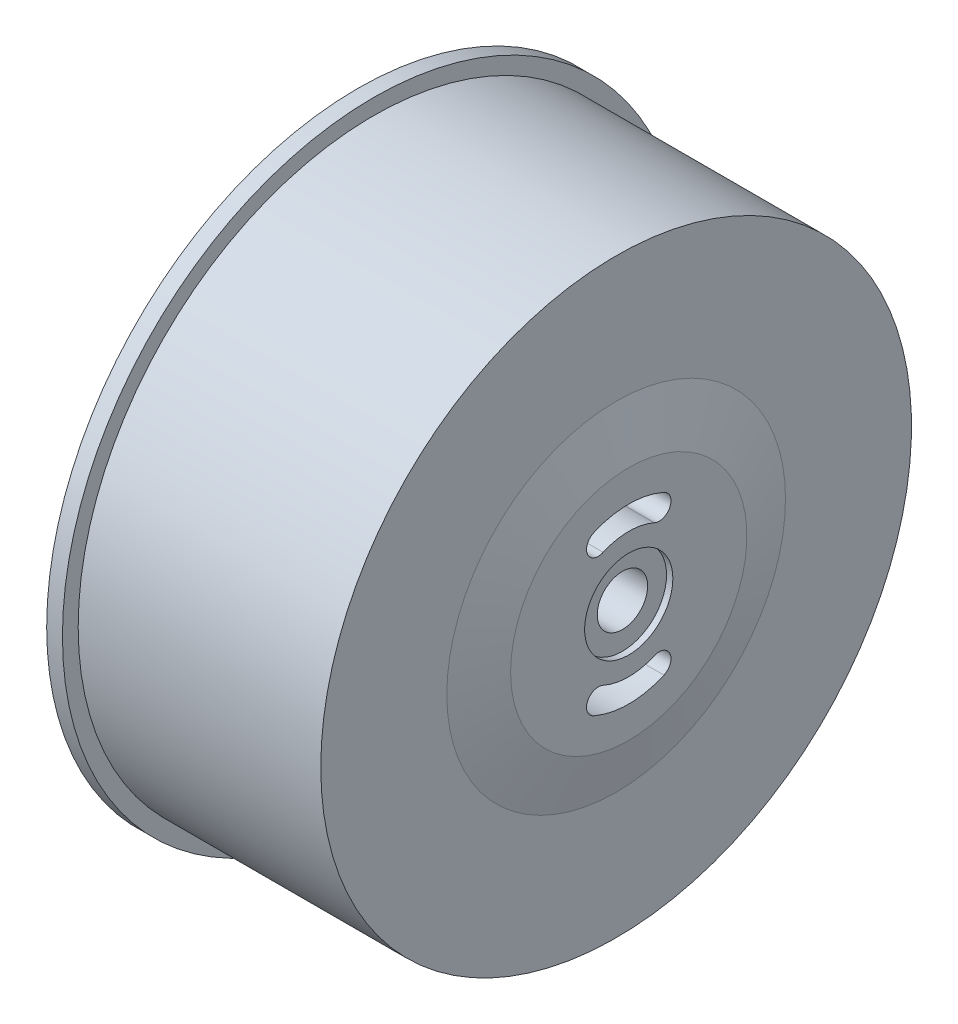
ISO-10303-21;
HEADER;
FILE_DESCRIPTION(('STEP AP214'),'2;1');
FILE_NAME('part.step','',(''),(''),'','','');
FILE_SCHEMA(('AUTOMOTIVE_DESIGN { 1 0 10303 214 1 1 1 1 }'));
ENDSEC;
DATA;
#1=APPLICATION_CONTEXT('core data for automotive mechanical design processes');
#2=APPLICATION_PROTOCOL_DEFINITION('international standard','automotive_design',2000,#1);
#3=PRODUCT_CONTEXT('',#1,'mechanical');
#4=PRODUCT('Part','Part','',(#3));
#5=PRODUCT_RELATED_PRODUCT_CATEGORY('part','',(#4));
#6=PRODUCT_DEFINITION_FORMATION('','',#4);
#7=PRODUCT_DEFINITION_CONTEXT('part definition',#1,'design');
#8=PRODUCT_DEFINITION('design','',#6,#7);
#9=PRODUCT_DEFINITION_SHAPE('','',#8);
#10=(LENGTH_UNIT() NAMED_UNIT(*) SI_UNIT(.MILLI.,.METRE.));
#11=(NAMED_UNIT(*) PLANE_ANGLE_UNIT() SI_UNIT($,.RADIAN.));
#12=(NAMED_UNIT(*) SI_UNIT($,.STERADIAN.) SOLID_ANGLE_UNIT());
#13=UNCERTAINTY_MEASURE_WITH_UNIT(LENGTH_MEASURE(1.E-05),#10,'distance_accuracy_value','');
#14=(GEOMETRIC_REPRESENTATION_CONTEXT(3) GLOBAL_UNCERTAINTY_ASSIGNED_CONTEXT((#13)) GLOBAL_UNIT_ASSIGNED_CONTEXT((#10,
#11,#12)) REPRESENTATION_CONTEXT('',''));
#15=CARTESIAN_POINT('',(0.,0.,0.));
#16=DIRECTION('',(0.,0.,1.));
#17=DIRECTION('',(1.,0.,0.));
#18=AXIS2_PLACEMENT_3D('',#15,#16,#17);
#19=CARTESIAN_POINT('',(17.2,0.,0.));
#20=DIRECTION('',(-1.,0.,0.));
#21=DIRECTION('',(0.,0.,1.));
#22=AXIS2_PLACEMENT_3D('',#19,#20,#21);
#23=CYLINDRICAL_SURFACE('',#22,1.6);
#24=CARTESIAN_POINT('',(10.9,0.,0.));
#25=DIRECTION('',(-1.,0.,0.));
#26=DIRECTION('',(0.,0.,1.));
#27=AXIS2_PLACEMENT_3D('',#24,#25,#26);
#28=CIRCLE('',#27,1.6);
#29=CARTESIAN_POINT('',(10.9,0.,1.6));
#30=VERTEX_POINT('',#29);
#31=EDGE_CURVE('E428',#30,#30,#28,.T.);
#32=ORIENTED_EDGE('',*,*,#31,.T.);
#33=EDGE_LOOP('',(#32));
#34=FACE_BOUND('',#33,.T.);
#35=CARTESIAN_POINT('',(16.8,0.,0.));
#36=DIRECTION('',(1.,0.,0.));
#37=DIRECTION('',(0.,0.,-1.));
#38=AXIS2_PLACEMENT_3D('',#35,#36,#37);
#39=CIRCLE('',#38,1.6);
#40=CARTESIAN_POINT('',(16.8,0.,-1.6));
#41=VERTEX_POINT('',#40);
#42=EDGE_CURVE('E36',#41,#41,#39,.F.);
#43=ORIENTED_EDGE('',*,*,#42,.F.);
#44=EDGE_LOOP('',(#43));
#45=FACE_BOUND('',#44,.T.);
#46=ADVANCED_FACE('F32',(#34,#45),#23,.F.);
#47=CARTESIAN_POINT('',(11.7,0.,0.));
#48=DIRECTION('',(-1.,0.,0.));
#49=DIRECTION('',(0.,0.,1.));
#50=AXIS2_PLACEMENT_3D('',#47,#48,#49);
#51=PLANE('',#50);
#52=CARTESIAN_POINT('',(11.7,0.,0.));
#53=DIRECTION('',(-1.,0.,0.));
#54=DIRECTION('',(0.,0.,1.));
#55=AXIS2_PLACEMENT_3D('',#52,#53,#54);
#56=CIRCLE('',#55,4.);
#57=CARTESIAN_POINT('',(11.7,0.,4.));
#58=VERTEX_POINT('',#57);
#59=EDGE_CURVE('E127',#58,#58,#56,.T.);
#60=ORIENTED_EDGE('',*,*,#59,.T.);
#61=EDGE_LOOP('',(#60));
#62=FACE_BOUND('',#61,.T.);
#63=CARTESIAN_POINT('',(11.7,0.,0.));
#64=DIRECTION('',(-1.,0.,0.));
#65=DIRECTION('',(0.,0.,1.));
#66=AXIS2_PLACEMENT_3D('',#63,#64,#65);
#67=CIRCLE('',#66,2.5);
#68=CARTESIAN_POINT('',(11.7,0.,2.5));
#69=VERTEX_POINT('',#68);
#70=EDGE_CURVE('E129',#69,#69,#67,.T.);
#71=ORIENTED_EDGE('',*,*,#70,.F.);
#72=EDGE_LOOP('',(#71));
#73=FACE_BOUND('',#72,.T.);
#74=ADVANCED_FACE('F225',(#62,#73),#51,.T.);
#75=CARTESIAN_POINT('',(14.7,16.25,0.));
#76=DIRECTION('',(1.,0.,0.));
#77=DIRECTION('',(0.,0.,-1.));
#78=AXIS2_PLACEMENT_3D('',#75,#76,#77);
#79=PLANE('',#78);
#80=CARTESIAN_POINT('',(14.7,0.,0.));
#81=DIRECTION('',(-1.,0.,0.));
#82=DIRECTION('',(0.,0.,1.));
#83=AXIS2_PLACEMENT_3D('',#80,#81,#82);
#84=CIRCLE('',#83,16.25);
#85=CARTESIAN_POINT('',(14.7,0.,16.25));
#86=VERTEX_POINT('',#85);
#87=EDGE_CURVE('E170',#86,#86,#84,.T.);
#88=ORIENTED_EDGE('',*,*,#87,.T.);
#89=EDGE_LOOP('',(#88));
#90=FACE_BOUND('',#89,.T.);
#91=CARTESIAN_POINT('',(14.7,0.,0.));
#92=DIRECTION('',(-1.,0.,0.));
#93=DIRECTION('',(0.,0.,1.));
#94=AXIS2_PLACEMENT_3D('',#91,#92,#93);
#95=CIRCLE('',#94,4.);
#96=CARTESIAN_POINT('',(14.7,-3.65500452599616,1.625097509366));
#97=VERTEX_POINT('',#96);
#98=CARTESIAN_POINT('',(14.7,3.65500452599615,1.62509750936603));
#99=VERTEX_POINT('',#98);
#100=EDGE_CURVE('E114',#97,#99,#95,.T.);
#101=ORIENTED_EDGE('',*,*,#100,.F.);
#102=CARTESIAN_POINT('',(14.7,-4.34031787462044,1.92980329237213));
#103=DIRECTION('',(1.,0.,0.));
#104=DIRECTION('',(0.,0.,-1.));
#105=AXIS2_PLACEMENT_3D('',#102,#103,#104);
#106=CIRCLE('',#105,0.750000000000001);
#107=CARTESIAN_POINT('',(14.7,-5.02563122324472,2.23450907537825));
#108=VERTEX_POINT('',#107);
#109=EDGE_CURVE('E98',#97,#108,#106,.T.);
#110=ORIENTED_EDGE('',*,*,#109,.T.);
#111=CARTESIAN_POINT('',(14.7,0.,0.));
#112=DIRECTION('',(1.,0.,0.));
#113=DIRECTION('',(0.,0.,-1.));
#114=AXIS2_PLACEMENT_3D('',#111,#112,#113);
#115=CIRCLE('',#114,5.5);
#116=CARTESIAN_POINT('',(14.7,-5.02563122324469,-2.23450907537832));
#117=VERTEX_POINT('',#116);
#118=EDGE_CURVE('E41',#108,#117,#115,.T.);
#119=ORIENTED_EDGE('',*,*,#118,.T.);
#120=CARTESIAN_POINT('',(14.7,-4.34031787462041,-1.92980329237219));
#121=DIRECTION('',(1.,0.,0.));
#122=DIRECTION('',(0.,0.,-1.));
#123=AXIS2_PLACEMENT_3D('',#120,#121,#122);
#124=CIRCLE('',#123,0.750000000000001);
#125=CARTESIAN_POINT('',(14.7,-3.65500452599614,-1.62509750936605));
#126=VERTEX_POINT('',#125);
#127=EDGE_CURVE('E11',#117,#126,#124,.T.);
#128=ORIENTED_EDGE('',*,*,#127,.T.);
#129=CARTESIAN_POINT('',(14.7,3.65500452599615,-1.62509750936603));
#130=VERTEX_POINT('',#129);
#131=EDGE_CURVE('E123',#130,#126,#95,.T.);
#132=ORIENTED_EDGE('',*,*,#131,.F.);
#133=CARTESIAN_POINT('',(14.7,4.34031787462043,-1.92980329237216));
#134=DIRECTION('',(1.,0.,0.));
#135=DIRECTION('',(0.,0.,-1.));
#136=AXIS2_PLACEMENT_3D('',#133,#134,#135);
#137=CIRCLE('',#136,0.750000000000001);
#138=CARTESIAN_POINT('',(14.7,5.02563122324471,-2.23450907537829));
#139=VERTEX_POINT('',#138);
#140=EDGE_CURVE('E188',#130,#139,#137,.T.);
#141=ORIENTED_EDGE('',*,*,#140,.T.);
#142=CARTESIAN_POINT('',(14.7,0.,0.));
#143=DIRECTION('',(1.,0.,0.));
#144=DIRECTION('',(0.,0.,-1.));
#145=AXIS2_PLACEMENT_3D('',#142,#143,#144);
#146=CIRCLE('',#145,5.5);
#147=CARTESIAN_POINT('',(14.7,5.02563122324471,2.23450907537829));
#148=VERTEX_POINT('',#147);
#149=EDGE_CURVE('E191',#139,#148,#146,.T.);
#150=ORIENTED_EDGE('',*,*,#149,.T.);
#151=CARTESIAN_POINT('',(14.7,4.34031787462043,1.92980329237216));
#152=DIRECTION('',(1.,0.,0.));
#153=DIRECTION('',(0.,0.,-1.));
#154=AXIS2_PLACEMENT_3D('',#151,#152,#153);
#155=CIRCLE('',#154,0.750000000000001);
#156=EDGE_CURVE('E108',#148,#99,#155,.T.);
#157=ORIENTED_EDGE('',*,*,#156,.T.);
#158=EDGE_LOOP('',(#101,#110,#119,#128,#132,#141,#150,#157));
#159=FACE_BOUND('',#158,.T.);
#160=ADVANCED_FACE('F121',(#90,#159),#79,.F.);
#161=CARTESIAN_POINT('',(14.7,0.,0.));
#162=DIRECTION('',(-1.,0.,0.));
#163=DIRECTION('',(0.,0.,1.));
#164=AXIS2_PLACEMENT_3D('',#161,#162,#163);
#165=CYLINDRICAL_SURFACE('',#164,19.75);
#166=CARTESIAN_POINT('',(0.,0.,0.));
#167=DIRECTION('',(-1.,0.,0.));
#168=DIRECTION('',(0.,0.,1.));
#169=AXIS2_PLACEMENT_3D('',#166,#167,#168);
#170=CIRCLE('',#169,19.75);
#171=CARTESIAN_POINT('',(0.,0.,19.75));
#172=VERTEX_POINT('',#171);
#173=EDGE_CURVE('E159',#172,#172,#170,.T.);
#174=ORIENTED_EDGE('',*,*,#173,.F.);
#175=EDGE_LOOP('',(#174));
#176=FACE_BOUND('',#175,.T.);
#177=CARTESIAN_POINT('',(0.999999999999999,0.,0.));
#178=DIRECTION('',(-1.,0.,0.));
#179=DIRECTION('',(0.,0.,1.));
#180=AXIS2_PLACEMENT_3D('',#177,#178,#179);
#181=CIRCLE('',#180,19.75);
#182=CARTESIAN_POINT('',(0.999999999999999,0.,19.75));
#183=VERTEX_POINT('',#182);
#184=EDGE_CURVE('E185',#183,#183,#181,.T.);
#185=ORIENTED_EDGE('',*,*,#184,.T.);
#186=EDGE_LOOP('',(#185));
#187=FACE_BOUND('',#186,.T.);
#188=ADVANCED_FACE('F34',(#176,#187),#165,.T.);
#189=CARTESIAN_POINT('',(1.,19.75,0.));
#190=DIRECTION('',(-1.,0.,0.));
#191=DIRECTION('',(0.,0.,1.));
#192=AXIS2_PLACEMENT_3D('',#189,#190,#191);
#193=PLANE('',#192);
#194=ORIENTED_EDGE('',*,*,#184,.F.);
#195=EDGE_LOOP('',(#194));
#196=FACE_BOUND('',#195,.T.);
#197=CARTESIAN_POINT('',(1.,0.,0.));
#198=DIRECTION('',(-1.,0.,0.));
#199=DIRECTION('',(0.,0.,1.));
#200=AXIS2_PLACEMENT_3D('',#197,#198,#199);
#201=CIRCLE('',#200,18.75);
#202=CARTESIAN_POINT('',(1.,0.,18.75));
#203=VERTEX_POINT('',#202);
#204=EDGE_CURVE('E182',#203,#203,#201,.T.);
#205=ORIENTED_EDGE('',*,*,#204,.T.);
#206=EDGE_LOOP('',(#205));
#207=FACE_BOUND('',#206,.T.);
#208=ADVANCED_FACE('F279',(#196,#207),#193,.F.);
#209=CARTESIAN_POINT('',(14.7,0.,0.));
#210=DIRECTION('',(-1.,0.,0.));
#211=DIRECTION('',(0.,0.,1.));
#212=AXIS2_PLACEMENT_3D('',#209,#210,#211);
#213=CYLINDRICAL_SURFACE('',#212,18.75);
#214=ORIENTED_EDGE('',*,*,#204,.F.);
#215=EDGE_LOOP('',(#214));
#216=FACE_BOUND('',#215,.T.);
#217=CARTESIAN_POINT('',(16.4,0.,0.));
#218=DIRECTION('',(-1.,0.,0.));
#219=DIRECTION('',(0.,0.,1.));
#220=AXIS2_PLACEMENT_3D('',#217,#218,#219);
#221=CIRCLE('',#220,18.75);
#222=CARTESIAN_POINT('',(16.4,0.,18.75));
#223=VERTEX_POINT('',#222);
#224=EDGE_CURVE('E179',#223,#223,#221,.T.);
#225=ORIENTED_EDGE('',*,*,#224,.T.);
#226=EDGE_LOOP('',(#225));
#227=FACE_BOUND('',#226,.T.);
#228=ADVANCED_FACE('F220',(#216,#227),#213,.T.);
#229=CARTESIAN_POINT('',(16.4,18.75,0.));
#230=DIRECTION('',(-1.,0.,0.));
#231=DIRECTION('',(0.,0.,1.));
#232=AXIS2_PLACEMENT_3D('',#229,#230,#231);
#233=PLANE('',#232);
#234=ORIENTED_EDGE('',*,*,#224,.F.);
#235=EDGE_LOOP('',(#234));
#236=FACE_BOUND('',#235,.T.);
#237=CARTESIAN_POINT('',(16.4,0.,0.));
#238=DIRECTION('',(-1.,0.,0.));
#239=DIRECTION('',(0.,0.,1.));
#240=AXIS2_PLACEMENT_3D('',#237,#238,#239);
#241=CIRCLE('',#240,10.75);
#242=CARTESIAN_POINT('',(16.4,0.,10.75));
#243=VERTEX_POINT('',#242);
#244=EDGE_CURVE('E176',#243,#243,#241,.T.);
#245=ORIENTED_EDGE('',*,*,#244,.T.);
#246=EDGE_LOOP('',(#245));
#247=FACE_BOUND('',#246,.T.);
#248=ADVANCED_FACE('F214',(#236,#247),#233,.F.);
#249=CARTESIAN_POINT('',(17.2,0.,0.));
#250=DIRECTION('',(-1.,0.,0.));
#251=DIRECTION('',(0.,0.,1.));
#252=AXIS2_PLACEMENT_3D('',#249,#250,#251);
#253=CONICAL_SURFACE('',#252,7.5,1.32944083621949);
#254=ORIENTED_EDGE('',*,*,#244,.F.);
#255=EDGE_LOOP('',(#254));
#256=FACE_BOUND('',#255,.T.);
#257=CARTESIAN_POINT('',(17.2,0.,0.));
#258=DIRECTION('',(-1.,0.,0.));
#259=DIRECTION('',(0.,0.,1.));
#260=AXIS2_PLACEMENT_3D('',#257,#258,#259);
#261=CIRCLE('',#260,7.5);
#262=CARTESIAN_POINT('',(17.2,0.,7.5));
#263=VERTEX_POINT('',#262);
#264=EDGE_CURVE('E173',#263,#263,#261,.T.);
#265=ORIENTED_EDGE('',*,*,#264,.T.);
#266=EDGE_LOOP('',(#265));
#267=FACE_BOUND('',#266,.T.);
#268=ADVANCED_FACE('F205',(#256,#267),#253,.T.);
#269=CARTESIAN_POINT('',(17.2,7.5,0.));
#270=DIRECTION('',(-1.,0.,0.));
#271=DIRECTION('',(0.,0.,1.));
#272=AXIS2_PLACEMENT_3D('',#269,#270,#271);
#273=PLANE('',#272);
#274=CARTESIAN_POINT('',(17.2,0.,0.));
#275=DIRECTION('',(1.,0.,0.));
#276=DIRECTION('',(0.,0.,-1.));
#277=AXIS2_PLACEMENT_3D('',#274,#275,#276);
#278=CIRCLE('',#277,2.8);
#279=CARTESIAN_POINT('',(17.2,0.,-2.8));
#280=VERTEX_POINT('',#279);
#281=EDGE_CURVE('E424',#280,#280,#278,.T.);
#282=ORIENTED_EDGE('',*,*,#281,.F.);
#283=EDGE_LOOP('',(#282));
#284=FACE_BOUND('',#283,.T.);
#285=CARTESIAN_POINT('',(17.2,0.,0.));
#286=DIRECTION('',(-1.,0.,0.));
#287=DIRECTION('',(0.,0.,1.));
#288=AXIS2_PLACEMENT_3D('',#285,#286,#287);
#289=CIRCLE('',#288,4.);
#290=CARTESIAN_POINT('',(17.2,-3.65500452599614,-1.62509750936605));
#291=VERTEX_POINT('',#290);
#292=CARTESIAN_POINT('',(17.2,-3.65500452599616,1.625097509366));
#293=VERTEX_POINT('',#292);
#294=EDGE_CURVE('E116',#291,#293,#289,.T.);
#295=ORIENTED_EDGE('',*,*,#294,.F.);
#296=CARTESIAN_POINT('',(17.2,-4.34031787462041,-1.92980329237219));
#297=DIRECTION('',(1.,0.,0.));
#298=DIRECTION('',(0.,0.,-1.));
#299=AXIS2_PLACEMENT_3D('',#296,#297,#298);
#300=CIRCLE('',#299,0.750000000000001);
#301=CARTESIAN_POINT('',(17.2,-5.02563122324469,-2.23450907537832));
#302=VERTEX_POINT('',#301);
#303=EDGE_CURVE('E48',#302,#291,#300,.T.);
#304=ORIENTED_EDGE('',*,*,#303,.F.);
#305=CARTESIAN_POINT('',(17.2,0.,0.));
#306=DIRECTION('',(1.,0.,0.));
#307=DIRECTION('',(0.,0.,1.));
#308=AXIS2_PLACEMENT_3D('',#305,#306,#307);
#309=CIRCLE('',#308,5.5);
#310=CARTESIAN_POINT('',(17.2,-5.02563122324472,2.23450907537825));
#311=VERTEX_POINT('',#310);
#312=EDGE_CURVE('E139',#311,#302,#309,.T.);
#313=ORIENTED_EDGE('',*,*,#312,.F.);
#314=CARTESIAN_POINT('',(17.2,-4.34031787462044,1.92980329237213));
#315=DIRECTION('',(1.,0.,0.));
#316=DIRECTION('',(0.,0.,1.));
#317=AXIS2_PLACEMENT_3D('',#314,#315,#316);
#318=CIRCLE('',#317,0.750000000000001);
#319=EDGE_CURVE('E137',#293,#311,#318,.T.);
#320=ORIENTED_EDGE('',*,*,#319,.F.);
#321=EDGE_LOOP('',(#295,#304,#313,#320));
#322=FACE_BOUND('',#321,.T.);
#323=CARTESIAN_POINT('',(17.2,0.,0.));
#324=DIRECTION('',(-1.,0.,0.));
#325=DIRECTION('',(0.,0.,-1.));
#326=AXIS2_PLACEMENT_3D('',#323,#324,#325);
#327=CIRCLE('',#326,4.);
#328=CARTESIAN_POINT('',(17.2,3.65500452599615,1.62509750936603));
#329=VERTEX_POINT('',#328);
#330=CARTESIAN_POINT('',(17.2,3.65500452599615,-1.62509750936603));
#331=VERTEX_POINT('',#330);
#332=EDGE_CURVE('E147',#329,#331,#327,.T.);
#333=ORIENTED_EDGE('',*,*,#332,.F.);
#334=CARTESIAN_POINT('',(17.2,4.34031787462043,1.92980329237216));
#335=DIRECTION('',(1.,0.,0.));
#336=DIRECTION('',(0.,0.,1.));
#337=AXIS2_PLACEMENT_3D('',#334,#335,#336);
#338=CIRCLE('',#337,0.750000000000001);
#339=CARTESIAN_POINT('',(17.2,5.02563122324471,2.23450907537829));
#340=VERTEX_POINT('',#339);
#341=EDGE_CURVE('E56',#340,#329,#338,.T.);
#342=ORIENTED_EDGE('',*,*,#341,.F.);
#343=CARTESIAN_POINT('',(17.2,0.,0.));
#344=DIRECTION('',(1.,0.,0.));
#345=DIRECTION('',(0.,0.,-1.));
#346=AXIS2_PLACEMENT_3D('',#343,#344,#345);
#347=CIRCLE('',#346,5.5);
#348=CARTESIAN_POINT('',(17.2,5.02563122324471,-2.23450907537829));
#349=VERTEX_POINT('',#348);
#350=EDGE_CURVE('E153',#349,#340,#347,.T.);
#351=ORIENTED_EDGE('',*,*,#350,.F.);
#352=CARTESIAN_POINT('',(17.2,4.34031787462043,-1.92980329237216));
#353=DIRECTION('',(1.,0.,0.));
#354=DIRECTION('',(0.,0.,-1.));
#355=AXIS2_PLACEMENT_3D('',#352,#353,#354);
#356=CIRCLE('',#355,0.750000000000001);
#357=EDGE_CURVE('E150',#331,#349,#356,.T.);
#358=ORIENTED_EDGE('',*,*,#357,.F.);
#359=EDGE_LOOP('',(#333,#342,#351,#358));
#360=FACE_BOUND('',#359,.T.);
#361=ORIENTED_EDGE('',*,*,#264,.F.);
#362=EDGE_LOOP('',(#361));
#363=FACE_BOUND('',#362,.T.);
#364=ADVANCED_FACE('F201',(#284,#322,#360,#363),#273,.F.);
#365=CARTESIAN_POINT('',(14.7,0.,0.));
#366=DIRECTION('',(-1.,0.,0.));
#367=DIRECTION('',(0.,0.,1.));
#368=AXIS2_PLACEMENT_3D('',#365,#366,#367);
#369=CYLINDRICAL_SURFACE('',#368,16.25);
#370=ORIENTED_EDGE('',*,*,#87,.F.);
#371=EDGE_LOOP('',(#370));
#372=FACE_BOUND('',#371,.T.);
#373=CARTESIAN_POINT('',(0.,0.,0.));
#374=DIRECTION('',(-1.,0.,0.));
#375=DIRECTION('',(0.,0.,1.));
#376=AXIS2_PLACEMENT_3D('',#373,#374,#375);
#377=CIRCLE('',#376,16.25);
#378=CARTESIAN_POINT('',(0.,0.,16.25));
#379=VERTEX_POINT('',#378);
#380=EDGE_CURVE('E167',#379,#379,#377,.T.);
#381=ORIENTED_EDGE('',*,*,#380,.T.);
#382=EDGE_LOOP('',(#381));
#383=FACE_BOUND('',#382,.T.);
#384=ADVANCED_FACE('F204',(#372,#383),#369,.F.);
#385=CARTESIAN_POINT('',(0.,16.25,0.));
#386=DIRECTION('',(1.,0.,0.));
#387=DIRECTION('',(0.,0.,-1.));
#388=AXIS2_PLACEMENT_3D('',#385,#386,#387);
#389=PLANE('',#388);
#390=ORIENTED_EDGE('',*,*,#380,.F.);
#391=EDGE_LOOP('',(#390));
#392=FACE_BOUND('',#391,.T.);
#393=ORIENTED_EDGE('',*,*,#173,.T.);
#394=EDGE_LOOP('',(#393));
#395=FACE_BOUND('',#394,.T.);
#396=ADVANCED_FACE('F267',(#392,#395),#389,.F.);
#397=CARTESIAN_POINT('',(0.,4.34031787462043,1.92980329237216));
#398=DIRECTION('',(1.,0.,0.));
#399=DIRECTION('',(0.,0.,-1.));
#400=AXIS2_PLACEMENT_3D('',#397,#398,#399);
#401=CYLINDRICAL_SURFACE('',#400,0.750000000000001);
#402=DIRECTION('',(1.,0.,0.));
#403=VECTOR('',#402,1.);
#404=CARTESIAN_POINT('',(0.,5.02563122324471,2.23450907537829));
#405=LINE('',#404,#403);
#406=EDGE_CURVE('E157',#148,#340,#405,.T.);
#407=ORIENTED_EDGE('',*,*,#406,.T.);
#408=ORIENTED_EDGE('',*,*,#341,.T.);
#409=DIRECTION('',(1.,0.,0.));
#410=VECTOR('',#409,1.);
#411=CARTESIAN_POINT('',(0.,3.65500452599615,1.62509750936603));
#412=LINE('',#411,#410);
#413=EDGE_CURVE('E156',#99,#329,#412,.T.);
#414=ORIENTED_EDGE('',*,*,#413,.F.);
#415=ORIENTED_EDGE('',*,*,#156,.F.);
#416=EDGE_LOOP('',(#407,#408,#414,#415));
#417=FACE_BOUND('',#416,.T.);
#418=ADVANCED_FACE('F258',(#417),#401,.F.);
#419=CARTESIAN_POINT('',(0.,0.,0.));
#420=DIRECTION('',(1.,0.,0.));
#421=DIRECTION('',(0.,0.,-1.));
#422=AXIS2_PLACEMENT_3D('',#419,#420,#421);
#423=CYLINDRICAL_SURFACE('',#422,5.5);
#424=DIRECTION('',(1.,0.,0.));
#425=VECTOR('',#424,1.);
#426=CARTESIAN_POINT('',(0.,5.02563122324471,-2.23450907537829));
#427=LINE('',#426,#425);
#428=EDGE_CURVE('E160',#139,#349,#427,.T.);
#429=ORIENTED_EDGE('',*,*,#428,.T.);
#430=ORIENTED_EDGE('',*,*,#350,.T.);
#431=ORIENTED_EDGE('',*,*,#406,.F.);
#432=ORIENTED_EDGE('',*,*,#149,.F.);
#433=EDGE_LOOP('',(#429,#430,#431,#432));
#434=FACE_BOUND('',#433,.T.);
#435=ADVANCED_FACE('F254',(#434),#423,.F.);
#436=CARTESIAN_POINT('',(0.,4.34031787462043,-1.92980329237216));
#437=DIRECTION('',(1.,0.,0.));
#438=DIRECTION('',(0.,0.,-1.));
#439=AXIS2_PLACEMENT_3D('',#436,#437,#438);
#440=CYLINDRICAL_SURFACE('',#439,0.750000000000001);
#441=DIRECTION('',(1.,0.,0.));
#442=VECTOR('',#441,1.);
#443=CARTESIAN_POINT('',(0.,3.65500452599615,-1.62509750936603));
#444=LINE('',#443,#442);
#445=EDGE_CURVE('E162',#130,#331,#444,.T.);
#446=ORIENTED_EDGE('',*,*,#445,.T.);
#447=ORIENTED_EDGE('',*,*,#357,.T.);
#448=ORIENTED_EDGE('',*,*,#428,.F.);
#449=ORIENTED_EDGE('',*,*,#140,.F.);
#450=EDGE_LOOP('',(#446,#447,#448,#449));
#451=FACE_BOUND('',#450,.T.);
#452=ADVANCED_FACE('F257',(#451),#440,.F.);
#453=CARTESIAN_POINT('',(0.,0.,0.));
#454=DIRECTION('',(1.,0.,0.));
#455=DIRECTION('',(0.,0.,-1.));
#456=AXIS2_PLACEMENT_3D('',#453,#454,#455);
#457=CYLINDRICAL_SURFACE('',#456,4.);
#458=ORIENTED_EDGE('',*,*,#413,.T.);
#459=ORIENTED_EDGE('',*,*,#332,.T.);
#460=ORIENTED_EDGE('',*,*,#445,.F.);
#461=ORIENTED_EDGE('',*,*,#131,.T.);
#462=DIRECTION('',(1.,0.,0.));
#463=VECTOR('',#462,1.);
#464=CARTESIAN_POINT('',(0.,-3.65500452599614,-1.62509750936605));
#465=LINE('',#464,#463);
#466=EDGE_CURVE('E118',#126,#291,#465,.T.);
#467=ORIENTED_EDGE('',*,*,#466,.T.);
#468=ORIENTED_EDGE('',*,*,#294,.T.);
#469=DIRECTION('',(1.,0.,0.));
#470=VECTOR('',#469,1.);
#471=CARTESIAN_POINT('',(0.,-3.65500452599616,1.625097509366));
#472=LINE('',#471,#470);
#473=EDGE_CURVE('E102',#97,#293,#472,.T.);
#474=ORIENTED_EDGE('',*,*,#473,.F.);
#475=ORIENTED_EDGE('',*,*,#100,.T.);
#476=EDGE_LOOP('',(#458,#459,#460,#461,#467,#468,#474,#475));
#477=FACE_BOUND('',#476,.T.);
#478=ORIENTED_EDGE('',*,*,#59,.F.);
#479=EDGE_LOOP('',(#478));
#480=FACE_BOUND('',#479,.T.);
#481=ADVANCED_FACE('F112',(#477,#480),#457,.T.);
#482=CARTESIAN_POINT('',(0.,-4.34031787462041,-1.92980329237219));
#483=DIRECTION('',(1.,0.,0.));
#484=DIRECTION('',(0.,0.,-1.));
#485=AXIS2_PLACEMENT_3D('',#482,#483,#484);
#486=CYLINDRICAL_SURFACE('',#485,0.750000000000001);
#487=DIRECTION('',(1.,0.,0.));
#488=VECTOR('',#487,1.);
#489=CARTESIAN_POINT('',(0.,-5.02563122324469,-2.23450907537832));
#490=LINE('',#489,#488);
#491=EDGE_CURVE('E142',#117,#302,#490,.T.);
#492=ORIENTED_EDGE('',*,*,#491,.T.);
#493=ORIENTED_EDGE('',*,*,#303,.T.);
#494=ORIENTED_EDGE('',*,*,#466,.F.);
#495=ORIENTED_EDGE('',*,*,#127,.F.);
#496=EDGE_LOOP('',(#492,#493,#494,#495));
#497=FACE_BOUND('',#496,.T.);
#498=ADVANCED_FACE('F198',(#497),#486,.F.);
#499=CARTESIAN_POINT('',(0.,0.,0.));
#500=DIRECTION('',(1.,0.,0.));
#501=DIRECTION('',(0.,0.,-1.));
#502=AXIS2_PLACEMENT_3D('',#499,#500,#501);
#503=CYLINDRICAL_SURFACE('',#502,5.5);
#504=DIRECTION('',(1.,0.,0.));
#505=VECTOR('',#504,1.);
#506=CARTESIAN_POINT('',(0.,-5.02563122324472,2.23450907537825));
#507=LINE('',#506,#505);
#508=EDGE_CURVE('E104',#108,#311,#507,.T.);
#509=ORIENTED_EDGE('',*,*,#508,.T.);
#510=ORIENTED_EDGE('',*,*,#312,.T.);
#511=ORIENTED_EDGE('',*,*,#491,.F.);
#512=ORIENTED_EDGE('',*,*,#118,.F.);
#513=EDGE_LOOP('',(#509,#510,#511,#512));
#514=FACE_BOUND('',#513,.T.);
#515=ADVANCED_FACE('F196',(#514),#503,.F.);
#516=CARTESIAN_POINT('',(0.,-4.34031787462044,1.92980329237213));
#517=DIRECTION('',(1.,0.,0.));
#518=DIRECTION('',(0.,0.,-1.));
#519=AXIS2_PLACEMENT_3D('',#516,#517,#518);
#520=CYLINDRICAL_SURFACE('',#519,0.750000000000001);
#521=ORIENTED_EDGE('',*,*,#473,.T.);
#522=ORIENTED_EDGE('',*,*,#319,.T.);
#523=ORIENTED_EDGE('',*,*,#508,.F.);
#524=ORIENTED_EDGE('',*,*,#109,.F.);
#525=EDGE_LOOP('',(#521,#522,#523,#524));
#526=FACE_BOUND('',#525,.T.);
#527=ADVANCED_FACE('F100',(#526),#520,.F.);
#528=CARTESIAN_POINT('',(10.9,0.,0.));
#529=DIRECTION('',(1.,0.,0.));
#530=DIRECTION('',(0.,0.,-1.));
#531=AXIS2_PLACEMENT_3D('',#528,#529,#530);
#532=CYLINDRICAL_SURFACE('',#531,2.5);
#533=CARTESIAN_POINT('',(10.9,0.,0.));
#534=DIRECTION('',(-1.,0.,0.));
#535=DIRECTION('',(0.,0.,1.));
#536=AXIS2_PLACEMENT_3D('',#533,#534,#535);
#537=CIRCLE('',#536,2.5);
#538=CARTESIAN_POINT('',(10.9,0.,2.5));
#539=VERTEX_POINT('',#538);
#540=EDGE_CURVE('E124',#539,#539,#537,.T.);
#541=ORIENTED_EDGE('',*,*,#540,.F.);
#542=EDGE_LOOP('',(#541));
#543=FACE_BOUND('',#542,.T.);
#544=ORIENTED_EDGE('',*,*,#70,.T.);
#545=EDGE_LOOP('',(#544));
#546=FACE_BOUND('',#545,.T.);
#547=ADVANCED_FACE('F243',(#543,#546),#532,.T.);
#548=CARTESIAN_POINT('',(10.9,0.,0.));
#549=DIRECTION('',(-1.,0.,0.));
#550=DIRECTION('',(0.,0.,1.));
#551=AXIS2_PLACEMENT_3D('',#548,#549,#550);
#552=PLANE('',#551);
#553=ORIENTED_EDGE('',*,*,#31,.F.);
#554=EDGE_LOOP('',(#553));
#555=FACE_BOUND('',#554,.T.);
#556=ORIENTED_EDGE('',*,*,#540,.T.);
#557=EDGE_LOOP('',(#556));
#558=FACE_BOUND('',#557,.T.);
#559=ADVANCED_FACE('F239',(#555,#558),#552,.T.);
#560=CARTESIAN_POINT('',(16.8,0.,0.));
#561=DIRECTION('',(1.,0.,0.));
#562=DIRECTION('',(0.,0.,-1.));
#563=AXIS2_PLACEMENT_3D('',#560,#561,#562);
#564=PLANE('',#563);
#565=CARTESIAN_POINT('',(16.8,0.,0.));
#566=DIRECTION('',(1.,0.,0.));
#567=DIRECTION('',(0.,0.,-1.));
#568=AXIS2_PLACEMENT_3D('',#565,#566,#567);
#569=CIRCLE('',#568,2.8);
#570=CARTESIAN_POINT('',(16.8,0.,-2.8));
#571=VERTEX_POINT('',#570);
#572=EDGE_CURVE('E421',#571,#571,#569,.T.);
#573=ORIENTED_EDGE('',*,*,#572,.T.);
#574=EDGE_LOOP('',(#573));
#575=FACE_BOUND('',#574,.T.);
#576=ORIENTED_EDGE('',*,*,#42,.T.);
#577=EDGE_LOOP('',(#576));
#578=FACE_BOUND('',#577,.T.);
#579=ADVANCED_FACE('F242',(#575,#578),#564,.T.);
#580=CARTESIAN_POINT('',(16.8,0.,0.));
#581=DIRECTION('',(1.,0.,0.));
#582=DIRECTION('',(0.,0.,-1.));
#583=AXIS2_PLACEMENT_3D('',#580,#581,#582);
#584=CYLINDRICAL_SURFACE('',#583,2.8);
#585=ORIENTED_EDGE('',*,*,#572,.F.);
#586=EDGE_LOOP('',(#585));
#587=FACE_BOUND('',#586,.T.);
#588=ORIENTED_EDGE('',*,*,#281,.T.);
#589=EDGE_LOOP('',(#588));
#590=FACE_BOUND('',#589,.T.);
#591=ADVANCED_FACE('F237',(#587,#590),#584,.F.);
#592=CLOSED_SHELL('',(#46,#74,#160,#188,#208,#228,#248,#268,#364,#384,#396,#418,#435,#452,#481,
#498,#515,#527,#547,#559,#579,#591));
#593=MANIFOLD_SOLID_BREP('B2',#592);
#594=ADVANCED_BREP_SHAPE_REPRESENTATION('',(#18,#593),#14);
#595=SHAPE_DEFINITION_REPRESENTATION(#9,#594);
ENDSEC;
END-ISO-10303-21;
